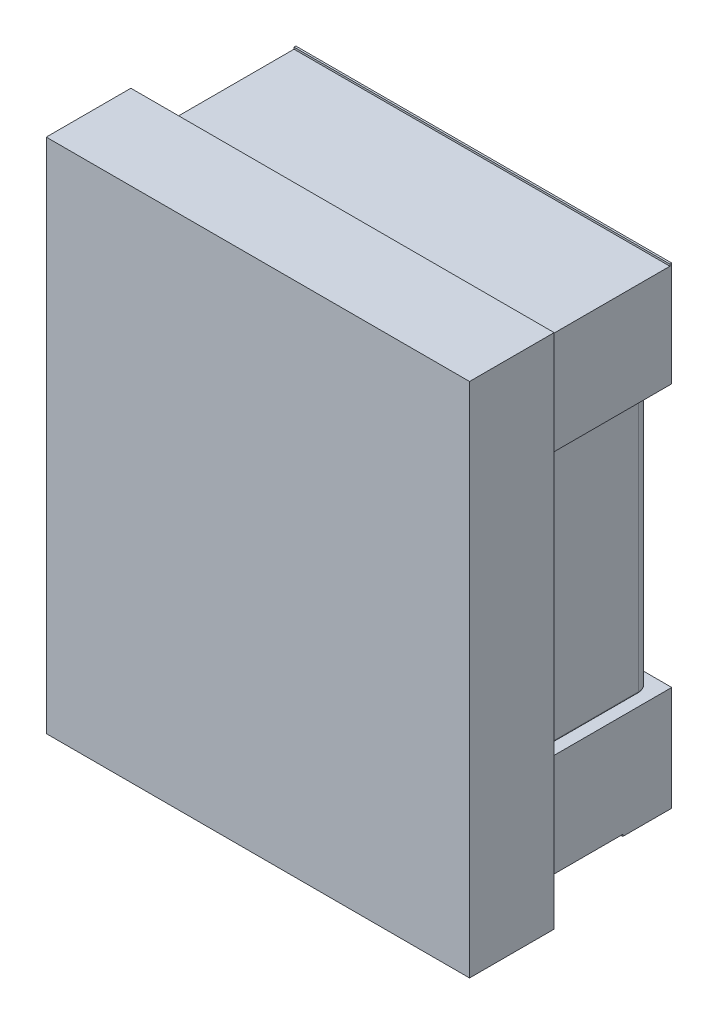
ISO-10303-21;
HEADER;
FILE_DESCRIPTION(('STEP AP214'),'2;1');
FILE_NAME('part.step','',(''),(''),'','','');
FILE_SCHEMA(('AUTOMOTIVE_DESIGN { 1 0 10303 214 1 1 1 1 }'));
ENDSEC;
DATA;
#1=APPLICATION_CONTEXT('core data for automotive mechanical design processes');
#2=APPLICATION_PROTOCOL_DEFINITION('international standard','automotive_design',2000,#1);
#3=PRODUCT_CONTEXT('',#1,'mechanical');
#4=PRODUCT('Part','Part','',(#3));
#5=PRODUCT_RELATED_PRODUCT_CATEGORY('part','',(#4));
#6=PRODUCT_DEFINITION_FORMATION('','',#4);
#7=PRODUCT_DEFINITION_CONTEXT('part definition',#1,'design');
#8=PRODUCT_DEFINITION('design','',#6,#7);
#9=PRODUCT_DEFINITION_SHAPE('','',#8);
#10=(LENGTH_UNIT() NAMED_UNIT(*) SI_UNIT(.MILLI.,.METRE.));
#11=(NAMED_UNIT(*) PLANE_ANGLE_UNIT() SI_UNIT($,.RADIAN.));
#12=(NAMED_UNIT(*) SI_UNIT($,.STERADIAN.) SOLID_ANGLE_UNIT());
#13=UNCERTAINTY_MEASURE_WITH_UNIT(LENGTH_MEASURE(1.E-05),#10,'distance_accuracy_value','');
#14=(GEOMETRIC_REPRESENTATION_CONTEXT(3) GLOBAL_UNCERTAINTY_ASSIGNED_CONTEXT((#13)) GLOBAL_UNIT_ASSIGNED_CONTEXT((#10,
#11,#12)) REPRESENTATION_CONTEXT('',''));
#15=CARTESIAN_POINT('',(0.,0.,0.));
#16=DIRECTION('',(0.,0.,1.));
#17=DIRECTION('',(1.,0.,0.));
#18=AXIS2_PLACEMENT_3D('',#15,#16,#17);
#19=CARTESIAN_POINT('',(15.5351000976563,40.8,0.0500000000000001));
#20=DIRECTION('',(0.,0.,1.));
#21=DIRECTION('',(0.,-1.,0.));
#22=AXIS2_PLACEMENT_3D('',#19,#20,#21);
#23=PLANE('',#22);
#24=DIRECTION('',(0.,-1.,0.));
#25=VECTOR('',#24,1.);
#26=CARTESIAN_POINT('',(15.6051000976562,40.8,0.0500000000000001));
#27=LINE('',#26,#25);
#28=CARTESIAN_POINT('',(15.6051000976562,40.79,0.0500000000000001));
#29=VERTEX_POINT('',#28);
#30=CARTESIAN_POINT('',(15.6051000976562,39.41,0.0500000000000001));
#31=VERTEX_POINT('',#30);
#32=EDGE_CURVE('E328',#29,#31,#27,.T.);
#33=ORIENTED_EDGE('',*,*,#32,.F.);
#34=DIRECTION('',(-1.,0.,0.));
#35=VECTOR('',#34,1.);
#36=CARTESIAN_POINT('',(15.5351000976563,40.79,0.0500000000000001));
#37=LINE('',#36,#35);
#38=CARTESIAN_POINT('',(17.3951000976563,40.79,0.0500000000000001));
#39=VERTEX_POINT('',#38);
#40=EDGE_CURVE('E330',#39,#29,#37,.T.);
#41=ORIENTED_EDGE('',*,*,#40,.F.);
#42=DIRECTION('',(0.,-1.,0.));
#43=VECTOR('',#42,1.);
#44=CARTESIAN_POINT('',(17.3951000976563,40.8,0.0500000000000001));
#45=LINE('',#44,#43);
#46=CARTESIAN_POINT('',(17.3951000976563,39.41,0.05));
#47=VERTEX_POINT('',#46);
#48=EDGE_CURVE('E331',#47,#39,#45,.F.);
#49=ORIENTED_EDGE('',*,*,#48,.F.);
#50=DIRECTION('',(1.,0.,0.));
#51=VECTOR('',#50,1.);
#52=CARTESIAN_POINT('',(15.5351000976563,39.41,0.0500000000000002));
#53=LINE('',#52,#51);
#54=EDGE_CURVE('E321',#31,#47,#53,.T.);
#55=ORIENTED_EDGE('',*,*,#54,.F.);
#56=EDGE_LOOP('',(#33,#41,#49,#55));
#57=FACE_BOUND('',#56,.T.);
#58=ADVANCED_FACE('F17',(#57),#23,.F.);
#59=CARTESIAN_POINT('',(15.5351000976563,40.79,0.0600000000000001));
#60=DIRECTION('',(-1.,0.,0.));
#61=DIRECTION('',(0.,-1.,0.));
#62=AXIS2_PLACEMENT_3D('',#59,#60,#61);
#63=CYLINDRICAL_SURFACE('',#62,0.01);
#64=DIRECTION('',(1.,0.,0.));
#65=VECTOR('',#64,1.);
#66=CARTESIAN_POINT('',(17.4651000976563,40.8,0.0600000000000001));
#67=LINE('',#66,#65);
#68=CARTESIAN_POINT('',(15.6051000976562,40.8,0.0600000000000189));
#69=VERTEX_POINT('',#68);
#70=CARTESIAN_POINT('',(17.3951000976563,40.8,0.0599999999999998));
#71=VERTEX_POINT('',#70);
#72=EDGE_CURVE('E676',#69,#71,#67,.T.);
#73=ORIENTED_EDGE('',*,*,#72,.T.);
#74=CARTESIAN_POINT('',(17.3951000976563,40.79,0.0600000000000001));
#75=DIRECTION('',(-1.,0.,0.));
#76=DIRECTION('',(0.,-1.,0.));
#77=AXIS2_PLACEMENT_3D('',#74,#75,#76);
#78=CIRCLE('',#77,0.01);
#79=EDGE_CURVE('E325',#71,#39,#78,.T.);
#80=ORIENTED_EDGE('',*,*,#79,.T.);
#81=ORIENTED_EDGE('',*,*,#40,.T.);
#82=CARTESIAN_POINT('',(15.6051000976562,40.79,0.0600000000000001));
#83=DIRECTION('',(-1.,0.,0.));
#84=DIRECTION('',(0.,-1.,0.));
#85=AXIS2_PLACEMENT_3D('',#82,#83,#84);
#86=CIRCLE('',#85,0.01);
#87=EDGE_CURVE('E339',#29,#69,#86,.F.);
#88=ORIENTED_EDGE('',*,*,#87,.T.);
#89=EDGE_LOOP('',(#73,#80,#81,#88));
#90=FACE_BOUND('',#89,.T.);
#91=ADVANCED_FACE('F956',(#90),#63,.T.);
#92=CARTESIAN_POINT('',(15.5351000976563,39.41,0.0600000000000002));
#93=DIRECTION('',(1.,0.,0.));
#94=DIRECTION('',(0.,1.,0.));
#95=AXIS2_PLACEMENT_3D('',#92,#93,#94);
#96=CYLINDRICAL_SURFACE('',#95,0.01);
#97=DIRECTION('',(-1.,0.,0.));
#98=VECTOR('',#97,1.);
#99=CARTESIAN_POINT('',(17.4651000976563,39.4,0.0600000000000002));
#100=LINE('',#99,#98);
#101=CARTESIAN_POINT('',(17.3951000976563,39.4,0.060000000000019));
#102=VERTEX_POINT('',#101);
#103=CARTESIAN_POINT('',(15.6051000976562,39.4,0.0600000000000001));
#104=VERTEX_POINT('',#103);
#105=EDGE_CURVE('E639',#102,#104,#100,.T.);
#106=ORIENTED_EDGE('',*,*,#105,.T.);
#107=CARTESIAN_POINT('',(15.6051000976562,39.41,0.0600000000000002));
#108=DIRECTION('',(1.,0.,0.));
#109=DIRECTION('',(0.,1.,0.));
#110=AXIS2_PLACEMENT_3D('',#107,#108,#109);
#111=CIRCLE('',#110,0.01);
#112=EDGE_CURVE('E430',#104,#31,#111,.T.);
#113=ORIENTED_EDGE('',*,*,#112,.T.);
#114=ORIENTED_EDGE('',*,*,#54,.T.);
#115=CARTESIAN_POINT('',(17.3951000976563,39.41,0.0600000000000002));
#116=DIRECTION('',(1.,0.,0.));
#117=DIRECTION('',(0.,1.,0.));
#118=AXIS2_PLACEMENT_3D('',#115,#116,#117);
#119=CIRCLE('',#118,0.01);
#120=EDGE_CURVE('E324',#47,#102,#119,.F.);
#121=ORIENTED_EDGE('',*,*,#120,.T.);
#122=EDGE_LOOP('',(#106,#113,#114,#121));
#123=FACE_BOUND('',#122,.T.);
#124=ADVANCED_FACE('F948',(#123),#96,.T.);
#125=CARTESIAN_POINT('',(17.4651000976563,40.8,0.1));
#126=DIRECTION('',(0.,-1.,0.));
#127=DIRECTION('',(1.,0.,0.));
#128=AXIS2_PLACEMENT_3D('',#125,#126,#127);
#129=PLANE('',#128);
#130=ORIENTED_EDGE('',*,*,#72,.F.);
#131=CARTESIAN_POINT('',(15.6051000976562,40.8,0.12));
#132=DIRECTION('',(0.,-1.,0.));
#133=DIRECTION('',(-1.,0.,0.));
#134=AXIS2_PLACEMENT_3D('',#131,#132,#133);
#135=CIRCLE('',#134,0.0599999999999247);
#136=CARTESIAN_POINT('',(15.5451000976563,40.8,0.12));
#137=VERTEX_POINT('',#136);
#138=EDGE_CURVE('E521',#137,#69,#135,.T.);
#139=ORIENTED_EDGE('',*,*,#138,.F.);
#140=DIRECTION('',(0.,0.,1.));
#141=VECTOR('',#140,1.);
#142=CARTESIAN_POINT('',(15.5451000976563,40.8,0.1));
#143=LINE('',#142,#141);
#144=CARTESIAN_POINT('',(15.5451000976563,40.8,0.753));
#145=VERTEX_POINT('',#144);
#146=EDGE_CURVE('E686',#145,#137,#143,.F.);
#147=ORIENTED_EDGE('',*,*,#146,.F.);
#148=DIRECTION('',(1.,0.,0.));
#149=VECTOR('',#148,1.);
#150=CARTESIAN_POINT('',(17.4651000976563,40.8,0.753));
#151=LINE('',#150,#149);
#152=CARTESIAN_POINT('',(15.5851000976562,40.8,0.753));
#153=VERTEX_POINT('',#152);
#154=EDGE_CURVE('E275',#153,#145,#151,.F.);
#155=ORIENTED_EDGE('',*,*,#154,.F.);
#156=DIRECTION('',(0.,0.,1.));
#157=VECTOR('',#156,1.);
#158=CARTESIAN_POINT('',(15.5851000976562,40.8,0.1));
#159=LINE('',#158,#157);
#160=CARTESIAN_POINT('',(15.5851000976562,40.8,0.1));
#161=VERTEX_POINT('',#160);
#162=EDGE_CURVE('E290',#161,#153,#159,.T.);
#163=ORIENTED_EDGE('',*,*,#162,.F.);
#164=DIRECTION('',(1.,0.,0.));
#165=VECTOR('',#164,1.);
#166=CARTESIAN_POINT('',(15.4851000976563,40.8,0.0999999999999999));
#167=LINE('',#166,#165);
#168=CARTESIAN_POINT('',(17.4151000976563,40.8,0.1));
#169=VERTEX_POINT('',#168);
#170=EDGE_CURVE('E297',#161,#169,#167,.T.);
#171=ORIENTED_EDGE('',*,*,#170,.T.);
#172=DIRECTION('',(0.,0.,1.));
#173=VECTOR('',#172,1.);
#174=CARTESIAN_POINT('',(17.4151000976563,40.8,0.1));
#175=LINE('',#174,#173);
#176=CARTESIAN_POINT('',(17.4151000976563,40.8,0.753));
#177=VERTEX_POINT('',#176);
#178=EDGE_CURVE('E292',#177,#169,#175,.F.);
#179=ORIENTED_EDGE('',*,*,#178,.F.);
#180=DIRECTION('',(1.,0.,0.));
#181=VECTOR('',#180,1.);
#182=CARTESIAN_POINT('',(17.4651000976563,40.8,0.753));
#183=LINE('',#182,#181);
#184=CARTESIAN_POINT('',(17.4551000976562,40.8,0.753));
#185=VERTEX_POINT('',#184);
#186=EDGE_CURVE('E306',#185,#177,#183,.F.);
#187=ORIENTED_EDGE('',*,*,#186,.F.);
#188=DIRECTION('',(0.,0.,1.));
#189=VECTOR('',#188,1.);
#190=CARTESIAN_POINT('',(17.4551000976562,40.8,0.1));
#191=LINE('',#190,#189);
#192=CARTESIAN_POINT('',(17.4551000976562,40.8,0.12));
#193=VERTEX_POINT('',#192);
#194=EDGE_CURVE('E308',#193,#185,#191,.T.);
#195=ORIENTED_EDGE('',*,*,#194,.F.);
#196=CARTESIAN_POINT('',(17.3951000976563,40.8,0.12));
#197=DIRECTION('',(0.,-1.,0.));
#198=DIRECTION('',(0.,0.,-1.));
#199=AXIS2_PLACEMENT_3D('',#196,#197,#198);
#200=CIRCLE('',#199,0.060000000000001);
#201=EDGE_CURVE('E656',#71,#193,#200,.T.);
#202=ORIENTED_EDGE('',*,*,#201,.F.);
#203=EDGE_LOOP('',(#130,#139,#147,#155,#163,#171,#179,#187,#195,#202));
#204=FACE_BOUND('',#203,.T.);
#205=ADVANCED_FACE('F631',(#204),#129,.F.);
#206=CARTESIAN_POINT('',(17.4651000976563,39.4,0.1));
#207=DIRECTION('',(0.,1.,0.));
#208=DIRECTION('',(-1.,0.,0.));
#209=AXIS2_PLACEMENT_3D('',#206,#207,#208);
#210=PLANE('',#209);
#211=ORIENTED_EDGE('',*,*,#105,.F.);
#212=CARTESIAN_POINT('',(17.3951000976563,39.4,0.12));
#213=DIRECTION('',(0.,1.,0.));
#214=DIRECTION('',(1.,0.,0.));
#215=AXIS2_PLACEMENT_3D('',#212,#213,#214);
#216=CIRCLE('',#215,0.0599999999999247);
#217=CARTESIAN_POINT('',(17.4551000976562,39.4,0.12));
#218=VERTEX_POINT('',#217);
#219=EDGE_CURVE('E442',#218,#102,#216,.T.);
#220=ORIENTED_EDGE('',*,*,#219,.F.);
#221=DIRECTION('',(0.,0.,1.));
#222=VECTOR('',#221,1.);
#223=CARTESIAN_POINT('',(17.4551000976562,39.4,0.1));
#224=LINE('',#223,#222);
#225=CARTESIAN_POINT('',(17.4551000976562,39.4,0.753));
#226=VERTEX_POINT('',#225);
#227=EDGE_CURVE('E649',#226,#218,#224,.F.);
#228=ORIENTED_EDGE('',*,*,#227,.F.);
#229=DIRECTION('',(-1.,0.,0.));
#230=VECTOR('',#229,1.);
#231=CARTESIAN_POINT('',(17.4651000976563,39.4,0.753));
#232=LINE('',#231,#230);
#233=CARTESIAN_POINT('',(17.4151000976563,39.4,0.753));
#234=VERTEX_POINT('',#233);
#235=EDGE_CURVE('E446',#234,#226,#232,.F.);
#236=ORIENTED_EDGE('',*,*,#235,.F.);
#237=DIRECTION('',(0.,0.,1.));
#238=VECTOR('',#237,1.);
#239=CARTESIAN_POINT('',(17.4151000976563,39.4,0.1));
#240=LINE('',#239,#238);
#241=CARTESIAN_POINT('',(17.4151000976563,39.4,0.1));
#242=VERTEX_POINT('',#241);
#243=EDGE_CURVE('E1027',#242,#234,#240,.T.);
#244=ORIENTED_EDGE('',*,*,#243,.F.);
#245=DIRECTION('',(1.,0.,0.));
#246=VECTOR('',#245,1.);
#247=CARTESIAN_POINT('',(15.4851000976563,39.4,0.1));
#248=LINE('',#247,#246);
#249=CARTESIAN_POINT('',(15.5851000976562,39.4,0.1));
#250=VERTEX_POINT('',#249);
#251=EDGE_CURVE('E607',#242,#250,#248,.F.);
#252=ORIENTED_EDGE('',*,*,#251,.T.);
#253=DIRECTION('',(0.,0.,1.));
#254=VECTOR('',#253,1.);
#255=CARTESIAN_POINT('',(15.5851000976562,39.4,0.1));
#256=LINE('',#255,#254);
#257=CARTESIAN_POINT('',(15.5851000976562,39.4,0.753));
#258=VERTEX_POINT('',#257);
#259=EDGE_CURVE('E1030',#258,#250,#256,.F.);
#260=ORIENTED_EDGE('',*,*,#259,.F.);
#261=DIRECTION('',(-1.,0.,0.));
#262=VECTOR('',#261,1.);
#263=CARTESIAN_POINT('',(17.4651000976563,39.4,0.753));
#264=LINE('',#263,#262);
#265=CARTESIAN_POINT('',(15.5451000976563,39.4,0.753));
#266=VERTEX_POINT('',#265);
#267=EDGE_CURVE('E655',#266,#258,#264,.F.);
#268=ORIENTED_EDGE('',*,*,#267,.F.);
#269=DIRECTION('',(0.,0.,1.));
#270=VECTOR('',#269,1.);
#271=CARTESIAN_POINT('',(15.5451000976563,39.4,0.1));
#272=LINE('',#271,#270);
#273=CARTESIAN_POINT('',(15.5451000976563,39.4,0.12));
#274=VERTEX_POINT('',#273);
#275=EDGE_CURVE('E653',#274,#266,#272,.T.);
#276=ORIENTED_EDGE('',*,*,#275,.F.);
#277=CARTESIAN_POINT('',(15.6051000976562,39.4,0.12));
#278=DIRECTION('',(0.,1.,0.));
#279=DIRECTION('',(0.,0.,-1.));
#280=AXIS2_PLACEMENT_3D('',#277,#278,#279);
#281=CIRCLE('',#280,0.0600000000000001);
#282=EDGE_CURVE('E298',#104,#274,#281,.T.);
#283=ORIENTED_EDGE('',*,*,#282,.F.);
#284=EDGE_LOOP('',(#211,#220,#228,#236,#244,#252,#260,#268,#276,#283));
#285=FACE_BOUND('',#284,.T.);
#286=ADVANCED_FACE('F620',(#285),#210,.F.);
#287=CARTESIAN_POINT('',(15.4851000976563,39.39,0.1));
#288=DIRECTION('',(0.,0.,1.));
#289=DIRECTION('',(0.,-1.,0.));
#290=AXIS2_PLACEMENT_3D('',#287,#288,#289);
#291=PLANE('',#290);
#292=DIRECTION('',(0.,-1.,0.));
#293=VECTOR('',#292,1.);
#294=CARTESIAN_POINT('',(17.4151000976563,39.39,0.1));
#295=LINE('',#294,#293);
#296=CARTESIAN_POINT('',(17.4151000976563,40.81,0.1));
#297=VERTEX_POINT('',#296);
#298=EDGE_CURVE('E303',#169,#297,#295,.F.);
#299=ORIENTED_EDGE('',*,*,#298,.F.);
#300=ORIENTED_EDGE('',*,*,#170,.F.);
#301=DIRECTION('',(0.,-1.,0.));
#302=VECTOR('',#301,1.);
#303=CARTESIAN_POINT('',(15.5851000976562,39.39,0.1));
#304=LINE('',#303,#302);
#305=CARTESIAN_POINT('',(15.5851000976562,40.81,0.1));
#306=VERTEX_POINT('',#305);
#307=EDGE_CURVE('E295',#306,#161,#304,.T.);
#308=ORIENTED_EDGE('',*,*,#307,.F.);
#309=DIRECTION('',(-1.,0.,0.));
#310=VECTOR('',#309,1.);
#311=CARTESIAN_POINT('',(15.4851000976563,40.81,0.1));
#312=LINE('',#311,#310);
#313=EDGE_CURVE('E596',#306,#297,#312,.F.);
#314=ORIENTED_EDGE('',*,*,#313,.T.);
#315=EDGE_LOOP('',(#299,#300,#308,#314));
#316=FACE_BOUND('',#315,.T.);
#317=ADVANCED_FACE('F630',(#316),#291,.F.);
#318=CARTESIAN_POINT('',(15.4851000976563,39.39,0.1));
#319=DIRECTION('',(0.,0.,1.));
#320=DIRECTION('',(0.,-1.,0.));
#321=AXIS2_PLACEMENT_3D('',#318,#319,#320);
#322=PLANE('',#321);
#323=DIRECTION('',(0.,-1.,0.));
#324=VECTOR('',#323,1.);
#325=CARTESIAN_POINT('',(15.5851000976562,39.39,0.1));
#326=LINE('',#325,#324);
#327=CARTESIAN_POINT('',(15.5851000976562,39.39,0.1));
#328=VERTEX_POINT('',#327);
#329=EDGE_CURVE('E605',#250,#328,#326,.T.);
#330=ORIENTED_EDGE('',*,*,#329,.F.);
#331=ORIENTED_EDGE('',*,*,#251,.F.);
#332=DIRECTION('',(0.,-1.,0.));
#333=VECTOR('',#332,1.);
#334=CARTESIAN_POINT('',(17.4151000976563,39.39,0.1));
#335=LINE('',#334,#333);
#336=CARTESIAN_POINT('',(17.4151000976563,39.39,0.1));
#337=VERTEX_POINT('',#336);
#338=EDGE_CURVE('E609',#337,#242,#335,.F.);
#339=ORIENTED_EDGE('',*,*,#338,.F.);
#340=DIRECTION('',(1.,0.,0.));
#341=VECTOR('',#340,1.);
#342=CARTESIAN_POINT('',(15.4851000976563,39.39,0.1));
#343=LINE('',#342,#341);
#344=EDGE_CURVE('E581',#337,#328,#343,.F.);
#345=ORIENTED_EDGE('',*,*,#344,.T.);
#346=EDGE_LOOP('',(#330,#331,#339,#345));
#347=FACE_BOUND('',#346,.T.);
#348=ADVANCED_FACE('F917',(#347),#322,.F.);
#349=CARTESIAN_POINT('',(15.4851000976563,40.81,0.));
#350=DIRECTION('',(0.,1.,0.));
#351=DIRECTION('',(-1.,0.,0.));
#352=AXIS2_PLACEMENT_3D('',#349,#350,#351);
#353=PLANE('',#352);
#354=DIRECTION('',(0.,0.,1.));
#355=VECTOR('',#354,1.);
#356=CARTESIAN_POINT('',(17.5151000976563,40.81,0.));
#357=LINE('',#356,#355);
#358=CARTESIAN_POINT('',(17.5151000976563,40.81,0.753));
#359=VERTEX_POINT('',#358);
#360=CARTESIAN_POINT('',(17.5151000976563,40.81,-0.0100000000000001));
#361=VERTEX_POINT('',#360);
#362=EDGE_CURVE('E590',#359,#361,#357,.F.);
#363=ORIENTED_EDGE('',*,*,#362,.F.);
#364=DIRECTION('',(-1.,0.,0.));
#365=VECTOR('',#364,1.);
#366=CARTESIAN_POINT('',(15.4851000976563,40.81,0.753));
#367=LINE('',#366,#365);
#368=CARTESIAN_POINT('',(17.4151000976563,40.81,0.753));
#369=VERTEX_POINT('',#368);
#370=EDGE_CURVE('E592',#369,#359,#367,.F.);
#371=ORIENTED_EDGE('',*,*,#370,.F.);
#372=DIRECTION('',(0.,0.,1.));
#373=VECTOR('',#372,1.);
#374=CARTESIAN_POINT('',(17.4151000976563,40.81,0.));
#375=LINE('',#374,#373);
#376=EDGE_CURVE('E594',#297,#369,#375,.T.);
#377=ORIENTED_EDGE('',*,*,#376,.F.);
#378=ORIENTED_EDGE('',*,*,#313,.F.);
#379=DIRECTION('',(0.,0.,1.));
#380=VECTOR('',#379,1.);
#381=CARTESIAN_POINT('',(15.5851000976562,40.81,0.));
#382=LINE('',#381,#380);
#383=CARTESIAN_POINT('',(15.5851000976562,40.81,0.753));
#384=VERTEX_POINT('',#383);
#385=EDGE_CURVE('E599',#384,#306,#382,.F.);
#386=ORIENTED_EDGE('',*,*,#385,.F.);
#387=DIRECTION('',(-1.,0.,0.));
#388=VECTOR('',#387,1.);
#389=CARTESIAN_POINT('',(15.4851000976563,40.81,0.753));
#390=LINE('',#389,#388);
#391=CARTESIAN_POINT('',(15.4851000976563,40.81,0.753));
#392=VERTEX_POINT('',#391);
#393=EDGE_CURVE('E601',#392,#384,#390,.F.);
#394=ORIENTED_EDGE('',*,*,#393,.F.);
#395=DIRECTION('',(0.,0.,1.));
#396=VECTOR('',#395,1.);
#397=CARTESIAN_POINT('',(15.4851000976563,40.81,0.));
#398=LINE('',#397,#396);
#399=CARTESIAN_POINT('',(15.4851000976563,40.81,-0.0100000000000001));
#400=VERTEX_POINT('',#399);
#401=EDGE_CURVE('E603',#400,#392,#398,.T.);
#402=ORIENTED_EDGE('',*,*,#401,.F.);
#403=DIRECTION('',(1.,0.,0.));
#404=VECTOR('',#403,1.);
#405=CARTESIAN_POINT('',(15.4851000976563,40.81,-0.0100000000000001));
#406=LINE('',#405,#404);
#407=EDGE_CURVE('E568',#400,#361,#406,.T.);
#408=ORIENTED_EDGE('',*,*,#407,.T.);
#409=EDGE_LOOP('',(#363,#371,#377,#378,#386,#394,#402,#408));
#410=FACE_BOUND('',#409,.T.);
#411=ADVANCED_FACE('F706',(#410),#353,.F.);
#412=CARTESIAN_POINT('',(15.4851000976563,39.39,0.));
#413=DIRECTION('',(0.,-1.,0.));
#414=DIRECTION('',(1.,0.,0.));
#415=AXIS2_PLACEMENT_3D('',#412,#413,#414);
#416=PLANE('',#415);
#417=DIRECTION('',(0.,0.,1.));
#418=VECTOR('',#417,1.);
#419=CARTESIAN_POINT('',(15.4851000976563,39.39,0.));
#420=LINE('',#419,#418);
#421=CARTESIAN_POINT('',(15.4851000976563,39.39,0.753));
#422=VERTEX_POINT('',#421);
#423=CARTESIAN_POINT('',(15.4851000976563,39.39,-0.00999999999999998));
#424=VERTEX_POINT('',#423);
#425=EDGE_CURVE('E575',#422,#424,#420,.F.);
#426=ORIENTED_EDGE('',*,*,#425,.F.);
#427=DIRECTION('',(1.,0.,0.));
#428=VECTOR('',#427,1.);
#429=CARTESIAN_POINT('',(15.4851000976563,39.39,0.753));
#430=LINE('',#429,#428);
#431=CARTESIAN_POINT('',(15.5851000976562,39.39,0.753));
#432=VERTEX_POINT('',#431);
#433=EDGE_CURVE('E577',#432,#422,#430,.F.);
#434=ORIENTED_EDGE('',*,*,#433,.F.);
#435=DIRECTION('',(0.,0.,1.));
#436=VECTOR('',#435,1.);
#437=CARTESIAN_POINT('',(15.5851000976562,39.39,0.));
#438=LINE('',#437,#436);
#439=EDGE_CURVE('E579',#328,#432,#438,.T.);
#440=ORIENTED_EDGE('',*,*,#439,.F.);
#441=ORIENTED_EDGE('',*,*,#344,.F.);
#442=DIRECTION('',(0.,0.,1.));
#443=VECTOR('',#442,1.);
#444=CARTESIAN_POINT('',(17.4151000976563,39.39,0.));
#445=LINE('',#444,#443);
#446=CARTESIAN_POINT('',(17.4151000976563,39.39,0.753));
#447=VERTEX_POINT('',#446);
#448=EDGE_CURVE('E584',#447,#337,#445,.F.);
#449=ORIENTED_EDGE('',*,*,#448,.F.);
#450=DIRECTION('',(1.,0.,0.));
#451=VECTOR('',#450,1.);
#452=CARTESIAN_POINT('',(15.4851000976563,39.39,0.753));
#453=LINE('',#452,#451);
#454=CARTESIAN_POINT('',(17.5151000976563,39.39,0.753));
#455=VERTEX_POINT('',#454);
#456=EDGE_CURVE('E586',#455,#447,#453,.F.);
#457=ORIENTED_EDGE('',*,*,#456,.F.);
#458=DIRECTION('',(0.,0.,1.));
#459=VECTOR('',#458,1.);
#460=CARTESIAN_POINT('',(17.5151000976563,39.39,0.));
#461=LINE('',#460,#459);
#462=CARTESIAN_POINT('',(17.5151000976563,39.39,-0.00999999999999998));
#463=VERTEX_POINT('',#462);
#464=EDGE_CURVE('E588',#463,#455,#461,.T.);
#465=ORIENTED_EDGE('',*,*,#464,.F.);
#466=DIRECTION('',(1.,0.,0.));
#467=VECTOR('',#466,1.);
#468=CARTESIAN_POINT('',(15.4851000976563,39.39,-0.00999999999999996));
#469=LINE('',#468,#467);
#470=EDGE_CURVE('E565',#463,#424,#469,.F.);
#471=ORIENTED_EDGE('',*,*,#470,.T.);
#472=EDGE_LOOP('',(#426,#434,#440,#441,#449,#457,#465,#471));
#473=FACE_BOUND('',#472,.T.);
#474=ADVANCED_FACE('F897',(#473),#416,.F.);
#475=CARTESIAN_POINT('',(15.4851000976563,41.375,-0.0100000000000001));
#476=DIRECTION('',(0.,0.,1.));
#477=DIRECTION('',(0.,-1.,0.));
#478=AXIS2_PLACEMENT_3D('',#475,#476,#477);
#479=PLANE('',#478);
#480=DIRECTION('',(0.,-1.,0.));
#481=VECTOR('',#480,1.);
#482=CARTESIAN_POINT('',(15.4851000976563,41.375,-0.0100000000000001));
#483=LINE('',#482,#481);
#484=CARTESIAN_POINT('',(15.4851000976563,41.375,-0.0100000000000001));
#485=VERTEX_POINT('',#484);
#486=EDGE_CURVE('E571',#485,#400,#483,.T.);
#487=ORIENTED_EDGE('',*,*,#486,.F.);
#488=DIRECTION('',(1.,0.,0.));
#489=VECTOR('',#488,1.);
#490=CARTESIAN_POINT('',(17.5151000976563,41.375,-0.0100000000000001));
#491=LINE('',#490,#489);
#492=CARTESIAN_POINT('',(17.5151000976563,41.375,-0.0100000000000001));
#493=VERTEX_POINT('',#492);
#494=EDGE_CURVE('E553',#485,#493,#491,.T.);
#495=ORIENTED_EDGE('',*,*,#494,.T.);
#496=DIRECTION('',(0.,-1.,0.));
#497=VECTOR('',#496,1.);
#498=CARTESIAN_POINT('',(17.5151000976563,41.375,-0.0100000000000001));
#499=LINE('',#498,#497);
#500=EDGE_CURVE('E573',#361,#493,#499,.F.);
#501=ORIENTED_EDGE('',*,*,#500,.F.);
#502=ORIENTED_EDGE('',*,*,#407,.F.);
#503=EDGE_LOOP('',(#487,#495,#501,#502));
#504=FACE_BOUND('',#503,.T.);
#505=ADVANCED_FACE('F726',(#504),#479,.F.);
#506=CARTESIAN_POINT('',(15.4851000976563,38.825,-0.00999999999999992));
#507=DIRECTION('',(0.,0.,1.));
#508=DIRECTION('',(0.,-1.,0.));
#509=AXIS2_PLACEMENT_3D('',#506,#507,#508);
#510=PLANE('',#509);
#511=DIRECTION('',(-1.,0.,0.));
#512=VECTOR('',#511,1.);
#513=CARTESIAN_POINT('',(15.4851000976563,38.825,-0.00999999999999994));
#514=LINE('',#513,#512);
#515=CARTESIAN_POINT('',(17.5151000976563,38.825,-0.00999999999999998));
#516=VERTEX_POINT('',#515);
#517=CARTESIAN_POINT('',(15.4851000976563,38.825,-0.00999999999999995));
#518=VERTEX_POINT('',#517);
#519=EDGE_CURVE('E548',#516,#518,#514,.T.);
#520=ORIENTED_EDGE('',*,*,#519,.T.);
#521=DIRECTION('',(0.,-1.,0.));
#522=VECTOR('',#521,1.);
#523=CARTESIAN_POINT('',(15.4851000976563,38.825,-0.00999999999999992));
#524=LINE('',#523,#522);
#525=EDGE_CURVE('E563',#424,#518,#524,.T.);
#526=ORIENTED_EDGE('',*,*,#525,.F.);
#527=ORIENTED_EDGE('',*,*,#470,.F.);
#528=DIRECTION('',(0.,-1.,0.));
#529=VECTOR('',#528,1.);
#530=CARTESIAN_POINT('',(17.5151000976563,38.825,-0.00999999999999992));
#531=LINE('',#530,#529);
#532=EDGE_CURVE('E560',#516,#463,#531,.F.);
#533=ORIENTED_EDGE('',*,*,#532,.F.);
#534=EDGE_LOOP('',(#520,#526,#527,#533));
#535=FACE_BOUND('',#534,.T.);
#536=ADVANCED_FACE('F879',(#535),#510,.F.);
#537=CARTESIAN_POINT('',(17.5151000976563,41.375,-0.0100000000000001));
#538=DIRECTION('',(0.,-1.,0.));
#539=DIRECTION('',(1.,0.,0.));
#540=AXIS2_PLACEMENT_3D('',#537,#538,#539);
#541=PLANE('',#540);
#542=DIRECTION('',(0.,0.,1.));
#543=VECTOR('',#542,1.);
#544=CARTESIAN_POINT('',(15.4851000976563,41.375,-0.0100000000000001));
#545=LINE('',#544,#543);
#546=CARTESIAN_POINT('',(15.4851000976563,41.375,0.));
#547=VERTEX_POINT('',#546);
#548=EDGE_CURVE('E556',#547,#485,#545,.F.);
#549=ORIENTED_EDGE('',*,*,#548,.F.);
#550=DIRECTION('',(1.,0.,0.));
#551=VECTOR('',#550,1.);
#552=CARTESIAN_POINT('',(15.4851000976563,41.375,0.));
#553=LINE('',#552,#551);
#554=CARTESIAN_POINT('',(17.5151000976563,41.375,0.));
#555=VERTEX_POINT('',#554);
#556=EDGE_CURVE('E481',#555,#547,#553,.F.);
#557=ORIENTED_EDGE('',*,*,#556,.F.);
#558=DIRECTION('',(0.,0.,1.));
#559=VECTOR('',#558,1.);
#560=CARTESIAN_POINT('',(17.5151000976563,41.375,-0.0100000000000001));
#561=LINE('',#560,#559);
#562=EDGE_CURVE('E558',#493,#555,#561,.T.);
#563=ORIENTED_EDGE('',*,*,#562,.F.);
#564=ORIENTED_EDGE('',*,*,#494,.F.);
#565=EDGE_LOOP('',(#549,#557,#563,#564));
#566=FACE_BOUND('',#565,.T.);
#567=ADVANCED_FACE('F731',(#566),#541,.F.);
#568=CARTESIAN_POINT('',(15.4851000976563,38.825,-0.00999999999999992));
#569=DIRECTION('',(0.,1.,0.));
#570=DIRECTION('',(-1.,0.,0.));
#571=AXIS2_PLACEMENT_3D('',#568,#569,#570);
#572=PLANE('',#571);
#573=ORIENTED_EDGE('',*,*,#519,.F.);
#574=DIRECTION('',(0.,0.,1.));
#575=VECTOR('',#574,1.);
#576=CARTESIAN_POINT('',(17.5151000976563,38.825,-0.00999999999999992));
#577=LINE('',#576,#575);
#578=CARTESIAN_POINT('',(17.5151000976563,38.825,0.254));
#579=VERTEX_POINT('',#578);
#580=EDGE_CURVE('E551',#579,#516,#577,.F.);
#581=ORIENTED_EDGE('',*,*,#580,.F.);
#582=DIRECTION('',(1.,0.,0.));
#583=VECTOR('',#582,1.);
#584=CARTESIAN_POINT('',(17.5151000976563,38.825,0.254));
#585=LINE('',#584,#583);
#586=CARTESIAN_POINT('',(15.4851000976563,38.825,0.254));
#587=VERTEX_POINT('',#586);
#588=EDGE_CURVE('E1112',#587,#579,#585,.T.);
#589=ORIENTED_EDGE('',*,*,#588,.F.);
#590=DIRECTION('',(0.,0.,1.));
#591=VECTOR('',#590,1.);
#592=CARTESIAN_POINT('',(15.4851000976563,38.825,-0.00999999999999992));
#593=LINE('',#592,#591);
#594=EDGE_CURVE('E541',#518,#587,#593,.T.);
#595=ORIENTED_EDGE('',*,*,#594,.F.);
#596=EDGE_LOOP('',(#573,#581,#589,#595));
#597=FACE_BOUND('',#596,.T.);
#598=ADVANCED_FACE('F862',(#597),#572,.F.);
#599=CARTESIAN_POINT('',(15.6051000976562,40.8,0.12));
#600=DIRECTION('',(0.,-1.,0.));
#601=DIRECTION('',(1.,0.,0.));
#602=AXIS2_PLACEMENT_3D('',#599,#600,#601);
#603=CYLINDRICAL_SURFACE('',#602,0.07);
#604=CARTESIAN_POINT('',(15.6051000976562,40.79,0.12));
#605=DIRECTION('',(0.,-1.,0.));
#606=DIRECTION('',(0.,0.,-1.));
#607=AXIS2_PLACEMENT_3D('',#604,#605,#606);
#608=CIRCLE('',#607,0.07);
#609=CARTESIAN_POINT('',(15.5351000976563,40.79,0.12));
#610=VERTEX_POINT('',#609);
#611=EDGE_CURVE('E539',#29,#610,#608,.F.);
#612=ORIENTED_EDGE('',*,*,#611,.F.);
#613=ORIENTED_EDGE('',*,*,#32,.T.);
#614=CARTESIAN_POINT('',(15.6051000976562,39.41,0.12));
#615=DIRECTION('',(0.,1.,0.));
#616=DIRECTION('',(0.,0.,1.));
#617=AXIS2_PLACEMENT_3D('',#614,#615,#616);
#618=CIRCLE('',#617,0.0700000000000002);
#619=CARTESIAN_POINT('',(15.5351000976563,39.41,0.12));
#620=VERTEX_POINT('',#619);
#621=EDGE_CURVE('E1115',#620,#31,#618,.F.);
#622=ORIENTED_EDGE('',*,*,#621,.F.);
#623=DIRECTION('',(0.,1.,0.));
#624=VECTOR('',#623,1.);
#625=CARTESIAN_POINT('',(15.5351000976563,39.4,0.12));
#626=LINE('',#625,#624);
#627=EDGE_CURVE('E268',#620,#610,#626,.T.);
#628=ORIENTED_EDGE('',*,*,#627,.T.);
#629=EDGE_LOOP('',(#612,#613,#622,#628));
#630=FACE_BOUND('',#629,.T.);
#631=ADVANCED_FACE('F534',(#630),#603,.T.);
#632=CARTESIAN_POINT('',(15.6051000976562,40.79,0.12));
#633=DIRECTION('',(0.,-1.,0.));
#634=DIRECTION('',(0.,0.,-1.));
#635=AXIS2_PLACEMENT_3D('',#632,#633,#634);
#636=TOROIDAL_SURFACE('',#635,0.0600000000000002,0.00999999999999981);
#637=ORIENTED_EDGE('',*,*,#87,.F.);
#638=ORIENTED_EDGE('',*,*,#611,.T.);
#639=CARTESIAN_POINT('',(15.5451000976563,40.79,0.12));
#640=DIRECTION('',(0.,0.,1.));
#641=DIRECTION('',(0.,-1.,0.));
#642=AXIS2_PLACEMENT_3D('',#639,#640,#641);
#643=CIRCLE('',#642,0.01);
#644=EDGE_CURVE('E267',#137,#610,#643,.T.);
#645=ORIENTED_EDGE('',*,*,#644,.F.);
#646=ORIENTED_EDGE('',*,*,#138,.T.);
#647=EDGE_LOOP('',(#637,#638,#645,#646));
#648=FACE_BOUND('',#647,.T.);
#649=ADVANCED_FACE('F524',(#648),#636,.T.);
#650=CARTESIAN_POINT('',(15.4851000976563,41.375,0.));
#651=DIRECTION('',(0.,0.,1.));
#652=DIRECTION('',(0.,-1.,0.));
#653=AXIS2_PLACEMENT_3D('',#650,#651,#652);
#654=PLANE('',#653);
#655=ORIENTED_EDGE('',*,*,#556,.T.);
#656=DIRECTION('',(0.,1.,0.));
#657=VECTOR('',#656,1.);
#658=CARTESIAN_POINT('',(15.4851000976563,41.365,0.));
#659=LINE('',#658,#657);
#660=CARTESIAN_POINT('',(15.4851000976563,41.365,0.));
#661=VERTEX_POINT('',#660);
#662=EDGE_CURVE('E400',#547,#661,#659,.F.);
#663=ORIENTED_EDGE('',*,*,#662,.T.);
#664=DIRECTION('',(1.,0.,0.));
#665=VECTOR('',#664,1.);
#666=CARTESIAN_POINT('',(15.4851000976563,41.365,0.));
#667=LINE('',#666,#665);
#668=CARTESIAN_POINT('',(17.5151000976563,41.365,0.));
#669=VERTEX_POINT('',#668);
#670=EDGE_CURVE('E394',#661,#669,#667,.T.);
#671=ORIENTED_EDGE('',*,*,#670,.T.);
#672=DIRECTION('',(0.,-1.,0.));
#673=VECTOR('',#672,1.);
#674=CARTESIAN_POINT('',(17.5151000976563,41.375,0.));
#675=LINE('',#674,#673);
#676=EDGE_CURVE('E538',#669,#555,#675,.F.);
#677=ORIENTED_EDGE('',*,*,#676,.T.);
#678=EDGE_LOOP('',(#655,#663,#671,#677));
#679=FACE_BOUND('',#678,.T.);
#680=ADVANCED_FACE('F495',(#679),#654,.T.);
#681=CARTESIAN_POINT('',(17.3951000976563,40.79,0.12));
#682=DIRECTION('',(0.,-1.,0.));
#683=DIRECTION('',(1.,0.,0.));
#684=AXIS2_PLACEMENT_3D('',#681,#682,#683);
#685=TOROIDAL_SURFACE('',#684,0.060000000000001,0.00999999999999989);
#686=CARTESIAN_POINT('',(17.3951000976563,40.79,0.12));
#687=DIRECTION('',(0.,-1.,0.));
#688=DIRECTION('',(1.,0.,0.));
#689=AXIS2_PLACEMENT_3D('',#686,#687,#688);
#690=CIRCLE('',#689,0.07);
#691=CARTESIAN_POINT('',(17.4651000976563,40.79,0.12));
#692=VERTEX_POINT('',#691);
#693=EDGE_CURVE('E472',#39,#692,#690,.T.);
#694=ORIENTED_EDGE('',*,*,#693,.F.);
#695=ORIENTED_EDGE('',*,*,#79,.F.);
#696=ORIENTED_EDGE('',*,*,#201,.T.);
#697=CARTESIAN_POINT('',(17.4551000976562,40.79,0.12));
#698=DIRECTION('',(0.,0.,1.));
#699=DIRECTION('',(0.,-1.,0.));
#700=AXIS2_PLACEMENT_3D('',#697,#698,#699);
#701=CIRCLE('',#700,0.01);
#702=EDGE_CURVE('E388',#692,#193,#701,.T.);
#703=ORIENTED_EDGE('',*,*,#702,.F.);
#704=EDGE_LOOP('',(#694,#695,#696,#703));
#705=FACE_BOUND('',#704,.T.);
#706=ADVANCED_FACE('F491',(#705),#685,.T.);
#707=CARTESIAN_POINT('',(17.3951000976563,40.8,0.12));
#708=DIRECTION('',(0.,-1.,0.));
#709=DIRECTION('',(1.,0.,0.));
#710=AXIS2_PLACEMENT_3D('',#707,#708,#709);
#711=CYLINDRICAL_SURFACE('',#710,0.07);
#712=CARTESIAN_POINT('',(17.3951000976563,39.41,0.12));
#713=DIRECTION('',(0.,1.,0.));
#714=DIRECTION('',(-1.,0.,0.));
#715=AXIS2_PLACEMENT_3D('',#712,#713,#714);
#716=CIRCLE('',#715,0.0700000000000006);
#717=CARTESIAN_POINT('',(17.4651000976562,39.41,0.12));
#718=VERTEX_POINT('',#717);
#719=EDGE_CURVE('E469',#47,#718,#716,.F.);
#720=ORIENTED_EDGE('',*,*,#719,.F.);
#721=ORIENTED_EDGE('',*,*,#48,.T.);
#722=ORIENTED_EDGE('',*,*,#693,.T.);
#723=DIRECTION('',(0.,1.,0.));
#724=VECTOR('',#723,1.);
#725=CARTESIAN_POINT('',(17.4651000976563,40.8,0.12));
#726=LINE('',#725,#724);
#727=EDGE_CURVE('E383',#718,#692,#726,.T.);
#728=ORIENTED_EDGE('',*,*,#727,.F.);
#729=EDGE_LOOP('',(#720,#721,#722,#728));
#730=FACE_BOUND('',#729,.T.);
#731=ADVANCED_FACE('F458',(#730),#711,.T.);
#732=CARTESIAN_POINT('',(17.3951000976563,39.41,0.12));
#733=DIRECTION('',(0.,1.,0.));
#734=DIRECTION('',(-1.,0.,0.));
#735=AXIS2_PLACEMENT_3D('',#732,#733,#734);
#736=TOROIDAL_SURFACE('',#735,0.060000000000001,0.00999999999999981);
#737=CARTESIAN_POINT('',(17.4551000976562,39.41,0.12));
#738=DIRECTION('',(0.,0.,-1.));
#739=DIRECTION('',(0.,1.,0.));
#740=AXIS2_PLACEMENT_3D('',#737,#738,#739);
#741=CIRCLE('',#740,0.01);
#742=EDGE_CURVE('E380',#218,#718,#741,.F.);
#743=ORIENTED_EDGE('',*,*,#742,.F.);
#744=ORIENTED_EDGE('',*,*,#219,.T.);
#745=ORIENTED_EDGE('',*,*,#120,.F.);
#746=ORIENTED_EDGE('',*,*,#719,.T.);
#747=EDGE_LOOP('',(#743,#744,#745,#746));
#748=FACE_BOUND('',#747,.T.);
#749=ADVANCED_FACE('F448',(#748),#736,.T.);
#750=CARTESIAN_POINT('',(17.5151000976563,38.835,0.254));
#751=DIRECTION('',(0.,0.,1.));
#752=DIRECTION('',(0.,-1.,0.));
#753=AXIS2_PLACEMENT_3D('',#750,#751,#752);
#754=PLANE('',#753);
#755=DIRECTION('',(0.,-1.,0.));
#756=VECTOR('',#755,1.);
#757=CARTESIAN_POINT('',(15.4851000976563,38.835,0.254));
#758=LINE('',#757,#756);
#759=CARTESIAN_POINT('',(15.4851000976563,38.835,0.254));
#760=VERTEX_POINT('',#759);
#761=EDGE_CURVE('E463',#760,#587,#758,.T.);
#762=ORIENTED_EDGE('',*,*,#761,.T.);
#763=ORIENTED_EDGE('',*,*,#588,.T.);
#764=DIRECTION('',(0.,-1.,0.));
#765=VECTOR('',#764,1.);
#766=CARTESIAN_POINT('',(17.5151000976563,41.365,0.254));
#767=LINE('',#766,#765);
#768=CARTESIAN_POINT('',(17.5151000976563,38.835,0.254));
#769=VERTEX_POINT('',#768);
#770=EDGE_CURVE('E378',#579,#769,#767,.F.);
#771=ORIENTED_EDGE('',*,*,#770,.T.);
#772=DIRECTION('',(-1.,0.,0.));
#773=VECTOR('',#772,1.);
#774=CARTESIAN_POINT('',(15.4851000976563,38.835,0.254));
#775=LINE('',#774,#773);
#776=EDGE_CURVE('E372',#769,#760,#775,.T.);
#777=ORIENTED_EDGE('',*,*,#776,.T.);
#778=EDGE_LOOP('',(#762,#763,#771,#777));
#779=FACE_BOUND('',#778,.T.);
#780=ADVANCED_FACE('F413',(#779),#754,.T.);
#781=CARTESIAN_POINT('',(15.6051000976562,39.41,0.12));
#782=DIRECTION('',(0.,1.,0.));
#783=DIRECTION('',(0.,0.,1.));
#784=AXIS2_PLACEMENT_3D('',#781,#782,#783);
#785=TOROIDAL_SURFACE('',#784,0.0600000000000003,0.00999999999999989);
#786=ORIENTED_EDGE('',*,*,#621,.T.);
#787=ORIENTED_EDGE('',*,*,#112,.F.);
#788=ORIENTED_EDGE('',*,*,#282,.T.);
#789=CARTESIAN_POINT('',(15.5451000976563,39.41,0.12));
#790=DIRECTION('',(0.,0.,-1.));
#791=DIRECTION('',(0.,1.,0.));
#792=AXIS2_PLACEMENT_3D('',#789,#790,#791);
#793=CIRCLE('',#792,0.01);
#794=EDGE_CURVE('E259',#620,#274,#793,.F.);
#795=ORIENTED_EDGE('',*,*,#794,.F.);
#796=EDGE_LOOP('',(#786,#787,#788,#795));
#797=FACE_BOUND('',#796,.T.);
#798=ADVANCED_FACE('F408',(#797),#785,.T.);
#799=CARTESIAN_POINT('',(15.5351000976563,39.4,1.16));
#800=DIRECTION('',(1.,0.,0.));
#801=DIRECTION('',(0.,1.,0.));
#802=AXIS2_PLACEMENT_3D('',#799,#800,#801);
#803=PLANE('',#802);
#804=DIRECTION('',(0.,0.,-1.));
#805=VECTOR('',#804,1.);
#806=CARTESIAN_POINT('',(15.5351000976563,39.41,1.16));
#807=LINE('',#806,#805);
#808=CARTESIAN_POINT('',(15.5351000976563,39.41,0.753));
#809=VERTEX_POINT('',#808);
#810=EDGE_CURVE('E254',#809,#620,#807,.T.);
#811=ORIENTED_EDGE('',*,*,#810,.F.);
#812=DIRECTION('',(0.,-1.,0.));
#813=VECTOR('',#812,1.);
#814=CARTESIAN_POINT('',(15.5351000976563,38.705,0.753));
#815=LINE('',#814,#813);
#816=CARTESIAN_POINT('',(15.5351000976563,40.79,0.753));
#817=VERTEX_POINT('',#816);
#818=EDGE_CURVE('E247',#809,#817,#815,.F.);
#819=ORIENTED_EDGE('',*,*,#818,.T.);
#820=DIRECTION('',(0.,0.,1.));
#821=VECTOR('',#820,1.);
#822=CARTESIAN_POINT('',(15.5351000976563,40.79,1.16));
#823=LINE('',#822,#821);
#824=EDGE_CURVE('E251',#610,#817,#823,.T.);
#825=ORIENTED_EDGE('',*,*,#824,.F.);
#826=ORIENTED_EDGE('',*,*,#627,.F.);
#827=EDGE_LOOP('',(#811,#819,#825,#826));
#828=FACE_BOUND('',#827,.T.);
#829=ADVANCED_FACE('F249',(#828),#803,.F.);
#830=CARTESIAN_POINT('',(15.5451000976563,40.79,1.16));
#831=DIRECTION('',(0.,0.,1.));
#832=DIRECTION('',(0.,-1.,0.));
#833=AXIS2_PLACEMENT_3D('',#830,#831,#832);
#834=CYLINDRICAL_SURFACE('',#833,0.01);
#835=ORIENTED_EDGE('',*,*,#146,.T.);
#836=ORIENTED_EDGE('',*,*,#644,.T.);
#837=ORIENTED_EDGE('',*,*,#824,.T.);
#838=CARTESIAN_POINT('',(15.5451000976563,40.79,0.753));
#839=DIRECTION('',(0.,0.,1.));
#840=DIRECTION('',(0.,-1.,0.));
#841=AXIS2_PLACEMENT_3D('',#838,#839,#840);
#842=CIRCLE('',#841,0.01);
#843=EDGE_CURVE('E20',#817,#145,#842,.F.);
#844=ORIENTED_EDGE('',*,*,#843,.T.);
#845=EDGE_LOOP('',(#835,#836,#837,#844));
#846=FACE_BOUND('',#845,.T.);
#847=ADVANCED_FACE('F264',(#846),#834,.T.);
#848=CARTESIAN_POINT('',(15.5851000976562,40.81,0.));
#849=DIRECTION('',(1.,0.,0.));
#850=DIRECTION('',(0.,1.,0.));
#851=AXIS2_PLACEMENT_3D('',#848,#849,#850);
#852=PLANE('',#851);
#853=ORIENTED_EDGE('',*,*,#162,.T.);
#854=DIRECTION('',(0.,-1.,0.));
#855=VECTOR('',#854,1.);
#856=CARTESIAN_POINT('',(15.5851000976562,38.705,0.753));
#857=LINE('',#856,#855);
#858=EDGE_CURVE('E276',#153,#384,#857,.F.);
#859=ORIENTED_EDGE('',*,*,#858,.T.);
#860=ORIENTED_EDGE('',*,*,#385,.T.);
#861=ORIENTED_EDGE('',*,*,#307,.T.);
#862=EDGE_LOOP('',(#853,#859,#860,#861));
#863=FACE_BOUND('',#862,.T.);
#864=ADVANCED_FACE('F805',(#863),#852,.F.);
#865=CARTESIAN_POINT('',(15.4851000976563,41.365,1.21));
#866=DIRECTION('',(1.,0.,0.));
#867=DIRECTION('',(0.,1.,0.));
#868=AXIS2_PLACEMENT_3D('',#865,#866,#867);
#869=PLANE('',#868);
#870=ORIENTED_EDGE('',*,*,#548,.T.);
#871=ORIENTED_EDGE('',*,*,#486,.T.);
#872=ORIENTED_EDGE('',*,*,#401,.T.);
#873=DIRECTION('',(0.,-1.,0.));
#874=VECTOR('',#873,1.);
#875=CARTESIAN_POINT('',(15.4851000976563,38.705,0.753));
#876=LINE('',#875,#874);
#877=CARTESIAN_POINT('',(15.4851000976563,41.365,0.753));
#878=VERTEX_POINT('',#877);
#879=EDGE_CURVE('E278',#392,#878,#876,.F.);
#880=ORIENTED_EDGE('',*,*,#879,.T.);
#881=DIRECTION('',(0.,0.,1.));
#882=VECTOR('',#881,1.);
#883=CARTESIAN_POINT('',(15.4851000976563,41.365,1.21));
#884=LINE('',#883,#882);
#885=EDGE_CURVE('E397',#878,#661,#884,.F.);
#886=ORIENTED_EDGE('',*,*,#885,.T.);
#887=ORIENTED_EDGE('',*,*,#662,.F.);
#888=EDGE_LOOP('',(#870,#871,#872,#880,#886,#887));
#889=FACE_BOUND('',#888,.T.);
#890=ADVANCED_FACE('F723',(#889),#869,.F.);
#891=CARTESIAN_POINT('',(15.4851000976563,41.365,1.21));
#892=DIRECTION('',(0.,-1.,0.));
#893=DIRECTION('',(1.,0.,0.));
#894=AXIS2_PLACEMENT_3D('',#891,#892,#893);
#895=PLANE('',#894);
#896=ORIENTED_EDGE('',*,*,#885,.F.);
#897=DIRECTION('',(1.,0.,0.));
#898=VECTOR('',#897,1.);
#899=CARTESIAN_POINT('',(15.3571000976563,41.365,0.753));
#900=LINE('',#899,#898);
#901=CARTESIAN_POINT('',(17.5151000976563,41.365,0.753));
#902=VERTEX_POINT('',#901);
#903=EDGE_CURVE('E282',#878,#902,#900,.T.);
#904=ORIENTED_EDGE('',*,*,#903,.T.);
#905=DIRECTION('',(0.,0.,1.));
#906=VECTOR('',#905,1.);
#907=CARTESIAN_POINT('',(17.5151000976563,41.365,1.21));
#908=LINE('',#907,#906);
#909=EDGE_CURVE('E391',#902,#669,#908,.F.);
#910=ORIENTED_EDGE('',*,*,#909,.T.);
#911=ORIENTED_EDGE('',*,*,#670,.F.);
#912=EDGE_LOOP('',(#896,#904,#910,#911));
#913=FACE_BOUND('',#912,.T.);
#914=ADVANCED_FACE('F719',(#913),#895,.F.);
#915=CARTESIAN_POINT('',(17.5151000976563,41.365,1.21));
#916=DIRECTION('',(-1.,0.,0.));
#917=DIRECTION('',(0.,-1.,0.));
#918=AXIS2_PLACEMENT_3D('',#915,#916,#917);
#919=PLANE('',#918);
#920=ORIENTED_EDGE('',*,*,#562,.T.);
#921=ORIENTED_EDGE('',*,*,#676,.F.);
#922=ORIENTED_EDGE('',*,*,#909,.F.);
#923=DIRECTION('',(0.,-1.,0.));
#924=VECTOR('',#923,1.);
#925=CARTESIAN_POINT('',(17.5151000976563,38.705,0.753));
#926=LINE('',#925,#924);
#927=EDGE_CURVE('E315',#902,#359,#926,.T.);
#928=ORIENTED_EDGE('',*,*,#927,.T.);
#929=ORIENTED_EDGE('',*,*,#362,.T.);
#930=ORIENTED_EDGE('',*,*,#500,.T.);
#931=EDGE_LOOP('',(#920,#921,#922,#928,#929,#930));
#932=FACE_BOUND('',#931,.T.);
#933=ADVANCED_FACE('F712',(#932),#919,.F.);
#934=CARTESIAN_POINT('',(17.4151000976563,40.81,0.));
#935=DIRECTION('',(-1.,0.,0.));
#936=DIRECTION('',(0.,-1.,0.));
#937=AXIS2_PLACEMENT_3D('',#934,#935,#936);
#938=PLANE('',#937);
#939=ORIENTED_EDGE('',*,*,#376,.T.);
#940=DIRECTION('',(0.,-1.,0.));
#941=VECTOR('',#940,1.);
#942=CARTESIAN_POINT('',(17.4151000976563,38.705,0.753));
#943=LINE('',#942,#941);
#944=EDGE_CURVE('E311',#369,#177,#943,.T.);
#945=ORIENTED_EDGE('',*,*,#944,.T.);
#946=ORIENTED_EDGE('',*,*,#178,.T.);
#947=ORIENTED_EDGE('',*,*,#298,.T.);
#948=EDGE_LOOP('',(#939,#945,#946,#947));
#949=FACE_BOUND('',#948,.T.);
#950=ADVANCED_FACE('F700',(#949),#938,.F.);
#951=CARTESIAN_POINT('',(17.4551000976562,40.79,0.1));
#952=DIRECTION('',(0.,0.,1.));
#953=DIRECTION('',(0.,-1.,0.));
#954=AXIS2_PLACEMENT_3D('',#951,#952,#953);
#955=CYLINDRICAL_SURFACE('',#954,0.01);
#956=DIRECTION('',(0.,0.,1.));
#957=VECTOR('',#956,1.);
#958=CARTESIAN_POINT('',(17.4651000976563,40.79,0.1));
#959=LINE('',#958,#957);
#960=CARTESIAN_POINT('',(17.4651000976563,40.79,0.753));
#961=VERTEX_POINT('',#960);
#962=EDGE_CURVE('E386',#692,#961,#959,.T.);
#963=ORIENTED_EDGE('',*,*,#962,.F.);
#964=ORIENTED_EDGE('',*,*,#702,.T.);
#965=ORIENTED_EDGE('',*,*,#194,.T.);
#966=CARTESIAN_POINT('',(17.4551000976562,40.79,0.753));
#967=DIRECTION('',(0.,0.,1.));
#968=DIRECTION('',(0.,-1.,0.));
#969=AXIS2_PLACEMENT_3D('',#966,#967,#968);
#970=CIRCLE('',#969,0.01);
#971=EDGE_CURVE('E314',#185,#961,#970,.F.);
#972=ORIENTED_EDGE('',*,*,#971,.T.);
#973=EDGE_LOOP('',(#963,#964,#965,#972));
#974=FACE_BOUND('',#973,.T.);
#975=ADVANCED_FACE('F691',(#974),#955,.T.);
#976=CARTESIAN_POINT('',(17.4651000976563,40.8,0.1));
#977=DIRECTION('',(1.,0.,0.));
#978=DIRECTION('',(0.,1.,0.));
#979=AXIS2_PLACEMENT_3D('',#976,#977,#978);
#980=PLANE('',#979);
#981=DIRECTION('',(0.,0.,-1.));
#982=VECTOR('',#981,1.);
#983=CARTESIAN_POINT('',(17.4651000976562,39.41,0.1));
#984=LINE('',#983,#982);
#985=CARTESIAN_POINT('',(17.4651000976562,39.41,0.753));
#986=VERTEX_POINT('',#985);
#987=EDGE_CURVE('E381',#718,#986,#984,.F.);
#988=ORIENTED_EDGE('',*,*,#987,.F.);
#989=ORIENTED_EDGE('',*,*,#727,.T.);
#990=ORIENTED_EDGE('',*,*,#962,.T.);
#991=DIRECTION('',(0.,-1.,0.));
#992=VECTOR('',#991,1.);
#993=CARTESIAN_POINT('',(17.4651000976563,38.705,0.753));
#994=LINE('',#993,#992);
#995=EDGE_CURVE('E349',#961,#986,#994,.T.);
#996=ORIENTED_EDGE('',*,*,#995,.T.);
#997=EDGE_LOOP('',(#988,#989,#990,#996));
#998=FACE_BOUND('',#997,.T.);
#999=ADVANCED_FACE('F791',(#998),#980,.T.);
#1000=CARTESIAN_POINT('',(17.4551000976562,39.41,0.1));
#1001=DIRECTION('',(0.,0.,-1.));
#1002=DIRECTION('',(0.,1.,0.));
#1003=AXIS2_PLACEMENT_3D('',#1000,#1001,#1002);
#1004=CYLINDRICAL_SURFACE('',#1003,0.01);
#1005=ORIENTED_EDGE('',*,*,#227,.T.);
#1006=ORIENTED_EDGE('',*,*,#742,.T.);
#1007=ORIENTED_EDGE('',*,*,#987,.T.);
#1008=CARTESIAN_POINT('',(17.4551000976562,39.41,0.753));
#1009=DIRECTION('',(0.,0.,-1.));
#1010=DIRECTION('',(0.,1.,0.));
#1011=AXIS2_PLACEMENT_3D('',#1008,#1009,#1010);
#1012=CIRCLE('',#1011,0.01);
#1013=EDGE_CURVE('E346',#986,#226,#1012,.T.);
#1014=ORIENTED_EDGE('',*,*,#1013,.T.);
#1015=EDGE_LOOP('',(#1005,#1006,#1007,#1014));
#1016=FACE_BOUND('',#1015,.T.);
#1017=ADVANCED_FACE('F787',(#1016),#1004,.T.);
#1018=CARTESIAN_POINT('',(17.4151000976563,40.81,0.));
#1019=DIRECTION('',(-1.,0.,0.));
#1020=DIRECTION('',(0.,-1.,0.));
#1021=AXIS2_PLACEMENT_3D('',#1018,#1019,#1020);
#1022=PLANE('',#1021);
#1023=ORIENTED_EDGE('',*,*,#243,.T.);
#1024=DIRECTION('',(0.,-1.,0.));
#1025=VECTOR('',#1024,1.);
#1026=CARTESIAN_POINT('',(17.4151000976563,38.705,0.753));
#1027=LINE('',#1026,#1025);
#1028=EDGE_CURVE('E348',#234,#447,#1027,.T.);
#1029=ORIENTED_EDGE('',*,*,#1028,.T.);
#1030=ORIENTED_EDGE('',*,*,#448,.T.);
#1031=ORIENTED_EDGE('',*,*,#338,.T.);
#1032=EDGE_LOOP('',(#1023,#1029,#1030,#1031));
#1033=FACE_BOUND('',#1032,.T.);
#1034=ADVANCED_FACE('F783',(#1033),#1022,.F.);
#1035=CARTESIAN_POINT('',(17.5151000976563,41.365,1.21));
#1036=DIRECTION('',(-1.,0.,0.));
#1037=DIRECTION('',(0.,-1.,0.));
#1038=AXIS2_PLACEMENT_3D('',#1035,#1036,#1037);
#1039=PLANE('',#1038);
#1040=ORIENTED_EDGE('',*,*,#580,.T.);
#1041=ORIENTED_EDGE('',*,*,#532,.T.);
#1042=ORIENTED_EDGE('',*,*,#464,.T.);
#1043=DIRECTION('',(0.,-1.,0.));
#1044=VECTOR('',#1043,1.);
#1045=CARTESIAN_POINT('',(17.5151000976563,38.705,0.753));
#1046=LINE('',#1045,#1044);
#1047=CARTESIAN_POINT('',(17.5151000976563,38.835,0.753));
#1048=VERTEX_POINT('',#1047);
#1049=EDGE_CURVE('E361',#455,#1048,#1046,.T.);
#1050=ORIENTED_EDGE('',*,*,#1049,.T.);
#1051=DIRECTION('',(0.,0.,1.));
#1052=VECTOR('',#1051,1.);
#1053=CARTESIAN_POINT('',(17.5151000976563,38.835,1.21));
#1054=LINE('',#1053,#1052);
#1055=EDGE_CURVE('E375',#1048,#769,#1054,.F.);
#1056=ORIENTED_EDGE('',*,*,#1055,.T.);
#1057=ORIENTED_EDGE('',*,*,#770,.F.);
#1058=EDGE_LOOP('',(#1040,#1041,#1042,#1050,#1056,#1057));
#1059=FACE_BOUND('',#1058,.T.);
#1060=ADVANCED_FACE('F779',(#1059),#1039,.F.);
#1061=CARTESIAN_POINT('',(15.4851000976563,38.835,1.21));
#1062=DIRECTION('',(0.,1.,0.));
#1063=DIRECTION('',(-1.,0.,0.));
#1064=AXIS2_PLACEMENT_3D('',#1061,#1062,#1063);
#1065=PLANE('',#1064);
#1066=ORIENTED_EDGE('',*,*,#1055,.F.);
#1067=DIRECTION('',(1.,0.,0.));
#1068=VECTOR('',#1067,1.);
#1069=CARTESIAN_POINT('',(15.3571000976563,38.835,0.753));
#1070=LINE('',#1069,#1068);
#1071=CARTESIAN_POINT('',(15.4851000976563,38.835,0.753));
#1072=VERTEX_POINT('',#1071);
#1073=EDGE_CURVE('E1057',#1048,#1072,#1070,.F.);
#1074=ORIENTED_EDGE('',*,*,#1073,.T.);
#1075=DIRECTION('',(0.,0.,1.));
#1076=VECTOR('',#1075,1.);
#1077=CARTESIAN_POINT('',(15.4851000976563,38.835,1.21));
#1078=LINE('',#1077,#1076);
#1079=EDGE_CURVE('E367',#1072,#760,#1078,.F.);
#1080=ORIENTED_EDGE('',*,*,#1079,.T.);
#1081=ORIENTED_EDGE('',*,*,#776,.F.);
#1082=EDGE_LOOP('',(#1066,#1074,#1080,#1081));
#1083=FACE_BOUND('',#1082,.T.);
#1084=ADVANCED_FACE('F775',(#1083),#1065,.F.);
#1085=CARTESIAN_POINT('',(15.4851000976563,41.365,1.21));
#1086=DIRECTION('',(1.,0.,0.));
#1087=DIRECTION('',(0.,1.,0.));
#1088=AXIS2_PLACEMENT_3D('',#1085,#1086,#1087);
#1089=PLANE('',#1088);
#1090=ORIENTED_EDGE('',*,*,#594,.T.);
#1091=ORIENTED_EDGE('',*,*,#761,.F.);
#1092=ORIENTED_EDGE('',*,*,#1079,.F.);
#1093=DIRECTION('',(0.,-1.,0.));
#1094=VECTOR('',#1093,1.);
#1095=CARTESIAN_POINT('',(15.4851000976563,38.705,0.753));
#1096=LINE('',#1095,#1094);
#1097=EDGE_CURVE('E1051',#1072,#422,#1096,.F.);
#1098=ORIENTED_EDGE('',*,*,#1097,.T.);
#1099=ORIENTED_EDGE('',*,*,#425,.T.);
#1100=ORIENTED_EDGE('',*,*,#525,.T.);
#1101=EDGE_LOOP('',(#1090,#1091,#1092,#1098,#1099,#1100));
#1102=FACE_BOUND('',#1101,.T.);
#1103=ADVANCED_FACE('F771',(#1102),#1089,.F.);
#1104=CARTESIAN_POINT('',(15.5851000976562,40.81,0.));
#1105=DIRECTION('',(1.,0.,0.));
#1106=DIRECTION('',(0.,1.,0.));
#1107=AXIS2_PLACEMENT_3D('',#1104,#1105,#1106);
#1108=PLANE('',#1107);
#1109=ORIENTED_EDGE('',*,*,#439,.T.);
#1110=DIRECTION('',(0.,-1.,0.));
#1111=VECTOR('',#1110,1.);
#1112=CARTESIAN_POINT('',(15.5851000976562,38.705,0.753));
#1113=LINE('',#1112,#1111);
#1114=EDGE_CURVE('E345',#432,#258,#1113,.F.);
#1115=ORIENTED_EDGE('',*,*,#1114,.T.);
#1116=ORIENTED_EDGE('',*,*,#259,.T.);
#1117=ORIENTED_EDGE('',*,*,#329,.T.);
#1118=EDGE_LOOP('',(#1109,#1115,#1116,#1117));
#1119=FACE_BOUND('',#1118,.T.);
#1120=ADVANCED_FACE('F767',(#1119),#1108,.F.);
#1121=CARTESIAN_POINT('',(15.5451000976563,39.41,1.16));
#1122=DIRECTION('',(0.,0.,-1.));
#1123=DIRECTION('',(0.,1.,0.));
#1124=AXIS2_PLACEMENT_3D('',#1121,#1122,#1123);
#1125=CYLINDRICAL_SURFACE('',#1124,0.01);
#1126=ORIENTED_EDGE('',*,*,#810,.T.);
#1127=ORIENTED_EDGE('',*,*,#794,.T.);
#1128=ORIENTED_EDGE('',*,*,#275,.T.);
#1129=CARTESIAN_POINT('',(15.5451000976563,39.41,0.753));
#1130=DIRECTION('',(0.,0.,-1.));
#1131=DIRECTION('',(0.,1.,0.));
#1132=AXIS2_PLACEMENT_3D('',#1129,#1130,#1131);
#1133=CIRCLE('',#1132,0.01);
#1134=EDGE_CURVE('E342',#266,#809,#1133,.T.);
#1135=ORIENTED_EDGE('',*,*,#1134,.T.);
#1136=EDGE_LOOP('',(#1126,#1127,#1128,#1135));
#1137=FACE_BOUND('',#1136,.T.);
#1138=ADVANCED_FACE('F764',(#1137),#1125,.T.);
#1139=CARTESIAN_POINT('',(15.3571000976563,38.705,0.753));
#1140=DIRECTION('',(0.,0.,1.));
#1141=DIRECTION('',(0.,-1.,0.));
#1142=AXIS2_PLACEMENT_3D('',#1139,#1140,#1141);
#1143=PLANE('',#1142);
#1144=ORIENTED_EDGE('',*,*,#267,.T.);
#1145=ORIENTED_EDGE('',*,*,#1114,.F.);
#1146=ORIENTED_EDGE('',*,*,#433,.T.);
#1147=ORIENTED_EDGE('',*,*,#1097,.F.);
#1148=ORIENTED_EDGE('',*,*,#1073,.F.);
#1149=ORIENTED_EDGE('',*,*,#1049,.F.);
#1150=ORIENTED_EDGE('',*,*,#456,.T.);
#1151=ORIENTED_EDGE('',*,*,#1028,.F.);
#1152=ORIENTED_EDGE('',*,*,#235,.T.);
#1153=ORIENTED_EDGE('',*,*,#1013,.F.);
#1154=ORIENTED_EDGE('',*,*,#995,.F.);
#1155=ORIENTED_EDGE('',*,*,#971,.F.);
#1156=ORIENTED_EDGE('',*,*,#186,.T.);
#1157=ORIENTED_EDGE('',*,*,#944,.F.);
#1158=ORIENTED_EDGE('',*,*,#370,.T.);
#1159=ORIENTED_EDGE('',*,*,#927,.F.);
#1160=ORIENTED_EDGE('',*,*,#903,.F.);
#1161=ORIENTED_EDGE('',*,*,#879,.F.);
#1162=ORIENTED_EDGE('',*,*,#393,.T.);
#1163=ORIENTED_EDGE('',*,*,#858,.F.);
#1164=ORIENTED_EDGE('',*,*,#154,.T.);
#1165=ORIENTED_EDGE('',*,*,#843,.F.);
#1166=ORIENTED_EDGE('',*,*,#818,.F.);
#1167=ORIENTED_EDGE('',*,*,#1134,.F.);
#1168=EDGE_LOOP('',(#1144,#1145,#1146,#1147,#1148,#1149,#1150,#1151,#1152,#1153,#1154,#1155,
#1156,#1157,#1158,#1159,#1160,#1161,#1162,#1163,#1164,#1165,#1166,#1167));
#1169=FACE_BOUND('',#1168,.T.);
#1170=DIRECTION('',(0.,1.,0.));
#1171=VECTOR('',#1170,1.);
#1172=CARTESIAN_POINT('',(17.6431000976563,41.495,0.753));
#1173=LINE('',#1172,#1171);
#1174=CARTESIAN_POINT('',(17.6431000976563,38.705,0.753));
#1175=VERTEX_POINT('',#1174);
#1176=CARTESIAN_POINT('',(17.6431000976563,41.495,0.753));
#1177=VERTEX_POINT('',#1176);
#1178=EDGE_CURVE('E1067',#1175,#1177,#1173,.T.);
#1179=ORIENTED_EDGE('',*,*,#1178,.F.);
#1180=DIRECTION('',(1.,0.,0.));
#1181=VECTOR('',#1180,1.);
#1182=CARTESIAN_POINT('',(17.6431000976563,38.705,0.753));
#1183=LINE('',#1182,#1181);
#1184=CARTESIAN_POINT('',(15.3571000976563,38.705,0.753));
#1185=VERTEX_POINT('',#1184);
#1186=EDGE_CURVE('E344',#1185,#1175,#1183,.T.);
#1187=ORIENTED_EDGE('',*,*,#1186,.F.);
#1188=DIRECTION('',(0.,-1.,0.));
#1189=VECTOR('',#1188,1.);
#1190=CARTESIAN_POINT('',(15.3571000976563,41.495,0.753));
#1191=LINE('',#1190,#1189);
#1192=CARTESIAN_POINT('',(15.3571000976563,41.495,0.753));
#1193=VERTEX_POINT('',#1192);
#1194=EDGE_CURVE('E1075',#1193,#1185,#1191,.T.);
#1195=ORIENTED_EDGE('',*,*,#1194,.F.);
#1196=DIRECTION('',(-1.,0.,0.));
#1197=VECTOR('',#1196,1.);
#1198=CARTESIAN_POINT('',(17.6431000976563,41.495,0.753));
#1199=LINE('',#1198,#1197);
#1200=EDGE_CURVE('E1072',#1177,#1193,#1199,.T.);
#1201=ORIENTED_EDGE('',*,*,#1200,.F.);
#1202=EDGE_LOOP('',(#1179,#1187,#1195,#1201));
#1203=FACE_BOUND('',#1202,.T.);
#1204=ADVANCED_FACE('F271',(#1169,#1203),#1143,.F.);
#1205=CARTESIAN_POINT('',(17.6431000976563,38.705,0.753));
#1206=DIRECTION('',(0.,-1.,0.));
#1207=DIRECTION('',(1.,0.,0.));
#1208=AXIS2_PLACEMENT_3D('',#1205,#1206,#1207);
#1209=PLANE('',#1208);
#1210=ORIENTED_EDGE('',*,*,#1186,.T.);
#1211=DIRECTION('',(0.,0.,1.));
#1212=VECTOR('',#1211,1.);
#1213=CARTESIAN_POINT('',(17.6431000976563,38.705,0.753));
#1214=LINE('',#1213,#1212);
#1215=CARTESIAN_POINT('',(17.6431000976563,38.705,1.21));
#1216=VERTEX_POINT('',#1215);
#1217=EDGE_CURVE('E1064',#1216,#1175,#1214,.F.);
#1218=ORIENTED_EDGE('',*,*,#1217,.F.);
#1219=DIRECTION('',(1.,0.,0.));
#1220=VECTOR('',#1219,1.);
#1221=CARTESIAN_POINT('',(17.5151000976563,38.705,1.21));
#1222=LINE('',#1221,#1220);
#1223=CARTESIAN_POINT('',(15.3571000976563,38.705,1.21));
#1224=VERTEX_POINT('',#1223);
#1225=EDGE_CURVE('E1081',#1224,#1216,#1222,.T.);
#1226=ORIENTED_EDGE('',*,*,#1225,.F.);
#1227=DIRECTION('',(0.,0.,1.));
#1228=VECTOR('',#1227,1.);
#1229=CARTESIAN_POINT('',(15.3571000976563,38.705,0.753));
#1230=LINE('',#1229,#1228);
#1231=EDGE_CURVE('E1078',#1185,#1224,#1230,.T.);
#1232=ORIENTED_EDGE('',*,*,#1231,.F.);
#1233=EDGE_LOOP('',(#1210,#1218,#1226,#1232));
#1234=FACE_BOUND('',#1233,.T.);
#1235=ADVANCED_FACE('F757',(#1234),#1209,.T.);
#1236=CARTESIAN_POINT('',(17.6431000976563,41.495,0.753));
#1237=DIRECTION('',(1.,0.,0.));
#1238=DIRECTION('',(0.,1.,0.));
#1239=AXIS2_PLACEMENT_3D('',#1236,#1237,#1238);
#1240=PLANE('',#1239);
#1241=ORIENTED_EDGE('',*,*,#1178,.T.);
#1242=DIRECTION('',(0.,0.,1.));
#1243=VECTOR('',#1242,1.);
#1244=CARTESIAN_POINT('',(17.6431000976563,41.495,0.753));
#1245=LINE('',#1244,#1243);
#1246=CARTESIAN_POINT('',(17.6431000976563,41.495,1.21));
#1247=VERTEX_POINT('',#1246);
#1248=EDGE_CURVE('E1069',#1247,#1177,#1245,.F.);
#1249=ORIENTED_EDGE('',*,*,#1248,.F.);
#1250=DIRECTION('',(0.,-1.,0.));
#1251=VECTOR('',#1250,1.);
#1252=CARTESIAN_POINT('',(17.6431000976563,38.835,1.21));
#1253=LINE('',#1252,#1251);
#1254=EDGE_CURVE('E1084',#1216,#1247,#1253,.F.);
#1255=ORIENTED_EDGE('',*,*,#1254,.F.);
#1256=ORIENTED_EDGE('',*,*,#1217,.T.);
#1257=EDGE_LOOP('',(#1241,#1249,#1255,#1256));
#1258=FACE_BOUND('',#1257,.T.);
#1259=ADVANCED_FACE('F754',(#1258),#1240,.T.);
#1260=CARTESIAN_POINT('',(17.6431000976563,41.495,0.753));
#1261=DIRECTION('',(0.,1.,0.));
#1262=DIRECTION('',(-1.,0.,0.));
#1263=AXIS2_PLACEMENT_3D('',#1260,#1261,#1262);
#1264=PLANE('',#1263);
#1265=ORIENTED_EDGE('',*,*,#1200,.T.);
#1266=DIRECTION('',(0.,0.,1.));
#1267=VECTOR('',#1266,1.);
#1268=CARTESIAN_POINT('',(15.3571000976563,41.495,0.753));
#1269=LINE('',#1268,#1267);
#1270=CARTESIAN_POINT('',(15.3571000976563,41.495,1.21));
#1271=VERTEX_POINT('',#1270);
#1272=EDGE_CURVE('E35',#1271,#1193,#1269,.F.);
#1273=ORIENTED_EDGE('',*,*,#1272,.F.);
#1274=DIRECTION('',(1.,0.,0.));
#1275=VECTOR('',#1274,1.);
#1276=CARTESIAN_POINT('',(17.5151000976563,41.495,1.21));
#1277=LINE('',#1276,#1275);
#1278=EDGE_CURVE('E26',#1247,#1271,#1277,.F.);
#1279=ORIENTED_EDGE('',*,*,#1278,.F.);
#1280=ORIENTED_EDGE('',*,*,#1248,.T.);
#1281=EDGE_LOOP('',(#1265,#1273,#1279,#1280));
#1282=FACE_BOUND('',#1281,.T.);
#1283=ADVANCED_FACE('F747',(#1282),#1264,.T.);
#1284=CARTESIAN_POINT('',(15.3571000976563,41.495,0.753));
#1285=DIRECTION('',(-1.,0.,0.));
#1286=DIRECTION('',(0.,-1.,0.));
#1287=AXIS2_PLACEMENT_3D('',#1284,#1285,#1286);
#1288=PLANE('',#1287);
#1289=ORIENTED_EDGE('',*,*,#1194,.T.);
#1290=ORIENTED_EDGE('',*,*,#1231,.T.);
#1291=DIRECTION('',(0.,-1.,0.));
#1292=VECTOR('',#1291,1.);
#1293=CARTESIAN_POINT('',(15.3571000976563,38.835,1.21));
#1294=LINE('',#1293,#1292);
#1295=EDGE_CURVE('E11',#1271,#1224,#1294,.T.);
#1296=ORIENTED_EDGE('',*,*,#1295,.F.);
#1297=ORIENTED_EDGE('',*,*,#1272,.T.);
#1298=EDGE_LOOP('',(#1289,#1290,#1296,#1297));
#1299=FACE_BOUND('',#1298,.T.);
#1300=ADVANCED_FACE('F741',(#1299),#1288,.T.);
#1301=CARTESIAN_POINT('',(17.5151000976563,38.835,1.21));
#1302=DIRECTION('',(0.,0.,1.));
#1303=DIRECTION('',(0.,-1.,0.));
#1304=AXIS2_PLACEMENT_3D('',#1301,#1302,#1303);
#1305=PLANE('',#1304);
#1306=ORIENTED_EDGE('',*,*,#1278,.T.);
#1307=ORIENTED_EDGE('',*,*,#1295,.T.);
#1308=ORIENTED_EDGE('',*,*,#1225,.T.);
#1309=ORIENTED_EDGE('',*,*,#1254,.T.);
#1310=EDGE_LOOP('',(#1306,#1307,#1308,#1309));
#1311=FACE_BOUND('',#1310,.T.);
#1312=ADVANCED_FACE('F739',(#1311),#1305,.T.);
#1313=CLOSED_SHELL('',(#58,#91,#124,#205,#286,#317,#348,#411,#474,#505,#536,#567,#598,#631,#649,
#680,#706,#731,#749,#780,#798,#829,#847,#864,#890,#914,#933,#950,#975,#999,#1017,#1034,#1060,
#1084,#1103,#1120,#1138,#1204,#1235,#1259,#1283,#1300,#1312));
#1314=MANIFOLD_SOLID_BREP('B1',#1313);
#1315=ADVANCED_BREP_SHAPE_REPRESENTATION('',(#18,#1314),#14);
#1316=SHAPE_DEFINITION_REPRESENTATION(#9,#1315);
ENDSEC;
END-ISO-10303-21;
